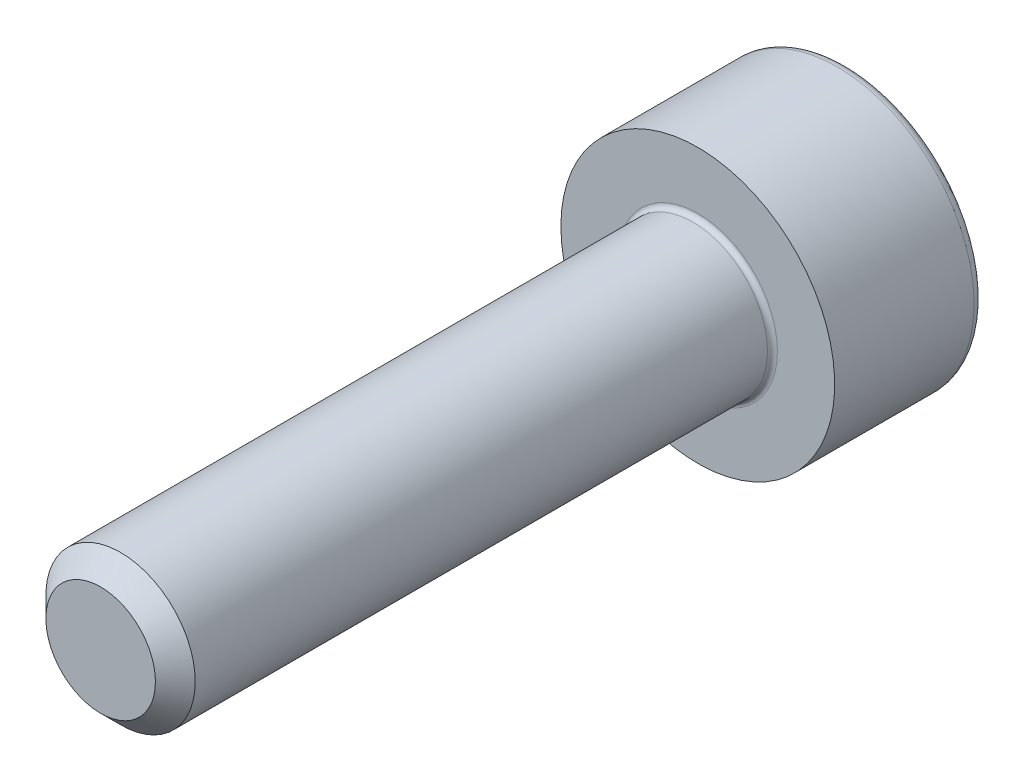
ISO-10303-21;
HEADER;
FILE_DESCRIPTION(('STEP AP214'),'2;1');
FILE_NAME('part.step','',(''),(''),'','','');
FILE_SCHEMA(('AUTOMOTIVE_DESIGN { 1 0 10303 214 1 1 1 1 }'));
ENDSEC;
DATA;
#1=APPLICATION_CONTEXT('core data for automotive mechanical design processes');
#2=APPLICATION_PROTOCOL_DEFINITION('international standard','automotive_design',2000,#1);
#3=PRODUCT_CONTEXT('',#1,'mechanical');
#4=PRODUCT('Part','Part','',(#3));
#5=PRODUCT_RELATED_PRODUCT_CATEGORY('part','',(#4));
#6=PRODUCT_DEFINITION_FORMATION('','',#4);
#7=PRODUCT_DEFINITION_CONTEXT('part definition',#1,'design');
#8=PRODUCT_DEFINITION('design','',#6,#7);
#9=PRODUCT_DEFINITION_SHAPE('','',#8);
#10=(LENGTH_UNIT() NAMED_UNIT(*) SI_UNIT(.MILLI.,.METRE.));
#11=(NAMED_UNIT(*) PLANE_ANGLE_UNIT() SI_UNIT($,.RADIAN.));
#12=(NAMED_UNIT(*) SI_UNIT($,.STERADIAN.) SOLID_ANGLE_UNIT());
#13=UNCERTAINTY_MEASURE_WITH_UNIT(LENGTH_MEASURE(1.E-05),#10,'distance_accuracy_value','');
#14=(GEOMETRIC_REPRESENTATION_CONTEXT(3) GLOBAL_UNCERTAINTY_ASSIGNED_CONTEXT((#13)) GLOBAL_UNIT_ASSIGNED_CONTEXT((#10,
#11,#12)) REPRESENTATION_CONTEXT('',''));
#15=CARTESIAN_POINT('',(0.,0.,0.));
#16=DIRECTION('',(0.,0.,1.));
#17=DIRECTION('',(1.,0.,0.));
#18=AXIS2_PLACEMENT_3D('',#15,#16,#17);
#19=CARTESIAN_POINT('',(14695.2255291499,-5639.90199648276,-590.000000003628));
#20=DIRECTION('',(0.,0.,-1.));
#21=DIRECTION('',(-1.,0.,0.));
#22=AXIS2_PLACEMENT_3D('',#19,#20,#21);
#23=CYLINDRICAL_SURFACE('',#22,2.7500000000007);
#24=CARTESIAN_POINT('',(14695.2255291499,-5639.90199648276,-592.800000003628));
#25=DIRECTION('',(0.,0.,-1.));
#26=DIRECTION('',(-1.,0.,0.));
#27=AXIS2_PLACEMENT_3D('',#24,#25,#26);
#28=CIRCLE('',#27,2.7500000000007);
#29=CARTESIAN_POINT('',(14692.4755291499,-5639.90199648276,-592.800000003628));
#30=VERTEX_POINT('',#29);
#31=EDGE_CURVE('E11',#30,#30,#28,.F.);
#32=ORIENTED_EDGE('',*,*,#31,.T.);
#33=EDGE_LOOP('',(#32));
#34=FACE_BOUND('',#33,.T.);
#35=CARTESIAN_POINT('',(14695.2255291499,-5639.90199648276,-590.000000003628));
#36=DIRECTION('',(0.,0.,-1.));
#37=DIRECTION('',(-1.,0.,0.));
#38=AXIS2_PLACEMENT_3D('',#35,#36,#37);
#39=CIRCLE('',#38,2.7500000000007);
#40=CARTESIAN_POINT('',(14692.4755291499,-5639.90199648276,-590.000000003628));
#41=VERTEX_POINT('',#40);
#42=EDGE_CURVE('E136',#41,#41,#39,.T.);
#43=ORIENTED_EDGE('',*,*,#42,.T.);
#44=EDGE_LOOP('',(#43));
#45=FACE_BOUND('',#44,.T.);
#46=ADVANCED_FACE('F34',(#34,#45),#23,.T.);
#47=CARTESIAN_POINT('',(14697.9755291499,-5639.90199648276,-590.000000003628));
#48=DIRECTION('',(0.,0.,1.));
#49=DIRECTION('',(1.,0.,0.));
#50=AXIS2_PLACEMENT_3D('',#47,#48,#49);
#51=PLANE('',#50);
#52=CARTESIAN_POINT('',(14695.2255291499,-5639.90199648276,-590.000000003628));
#53=DIRECTION('',(0.,0.,1.));
#54=DIRECTION('',(1.,0.,0.));
#55=AXIS2_PLACEMENT_3D('',#52,#53,#54);
#56=CIRCLE('',#55,1.60000000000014);
#57=CARTESIAN_POINT('',(14696.8255291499,-5639.90199648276,-590.000000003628));
#58=VERTEX_POINT('',#57);
#59=EDGE_CURVE('E153',#58,#58,#56,.F.);
#60=ORIENTED_EDGE('',*,*,#59,.T.);
#61=EDGE_LOOP('',(#60));
#62=FACE_BOUND('',#61,.T.);
#63=ORIENTED_EDGE('',*,*,#42,.F.);
#64=EDGE_LOOP('',(#63));
#65=FACE_BOUND('',#64,.T.);
#66=ADVANCED_FACE('F171',(#62,#65),#51,.T.);
#67=CARTESIAN_POINT('',(14695.2255291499,-5639.90199648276,-593.000000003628));
#68=DIRECTION('',(0.,0.,-1.));
#69=DIRECTION('',(-1.,0.,0.));
#70=AXIS2_PLACEMENT_3D('',#67,#68,#69);
#71=PLANE('',#70);
#72=CARTESIAN_POINT('',(14695.2255291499,-5639.90199648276,-593.000000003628));
#73=DIRECTION('',(0.,0.,-1.));
#74=DIRECTION('',(-1.,0.,0.));
#75=AXIS2_PLACEMENT_3D('',#72,#73,#74);
#76=CIRCLE('',#75,2.55000000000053);
#77=CARTESIAN_POINT('',(14692.6755291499,-5639.90199648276,-593.000000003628));
#78=VERTEX_POINT('',#77);
#79=EDGE_CURVE('E42',#78,#78,#76,.T.);
#80=ORIENTED_EDGE('',*,*,#79,.T.);
#81=EDGE_LOOP('',(#80));
#82=FACE_BOUND('',#81,.T.);
#83=DIRECTION('',(0.50000000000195,0.866025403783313,0.));
#84=VECTOR('',#83,1.);
#85=CARTESIAN_POINT('',(14693.7821534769,-5639.90199648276,-593.000000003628));
#86=LINE('',#85,#84);
#87=CARTESIAN_POINT('',(14693.7821534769,-5639.90199648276,-593.000000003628));
#88=VERTEX_POINT('',#87);
#89=CARTESIAN_POINT('',(14694.5038413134,-5638.65199648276,-593.000000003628));
#90=VERTEX_POINT('',#89);
#91=EDGE_CURVE('E49',#88,#90,#86,.T.);
#92=ORIENTED_EDGE('',*,*,#91,.F.);
#93=DIRECTION('',(-0.500000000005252,0.866025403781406,0.));
#94=VECTOR('',#93,1.);
#95=CARTESIAN_POINT('',(14694.5038413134,-5641.15199648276,-593.000000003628));
#96=LINE('',#95,#94);
#97=CARTESIAN_POINT('',(14694.5038413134,-5641.15199648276,-593.000000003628));
#98=VERTEX_POINT('',#97);
#99=EDGE_CURVE('E132',#98,#88,#96,.T.);
#100=ORIENTED_EDGE('',*,*,#99,.F.);
#101=DIRECTION('',(-1.,1.23069611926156E-12,0.));
#102=VECTOR('',#101,1.);
#103=CARTESIAN_POINT('',(14695.9472169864,-5641.15199648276,-593.000000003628));
#104=LINE('',#103,#102);
#105=CARTESIAN_POINT('',(14695.9472169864,-5641.15199648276,-593.000000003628));
#106=VERTEX_POINT('',#105);
#107=EDGE_CURVE('E130',#106,#98,#104,.T.);
#108=ORIENTED_EDGE('',*,*,#107,.F.);
#109=DIRECTION('',(-0.500000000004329,-0.866025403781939,0.));
#110=VECTOR('',#109,1.);
#111=CARTESIAN_POINT('',(14696.6689048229,-5639.90199648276,-593.000000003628));
#112=LINE('',#111,#110);
#113=CARTESIAN_POINT('',(14696.6689048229,-5639.90199648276,-593.000000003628));
#114=VERTEX_POINT('',#113);
#115=EDGE_CURVE('E97',#114,#106,#112,.T.);
#116=ORIENTED_EDGE('',*,*,#115,.F.);
#117=DIRECTION('',(0.500000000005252,-0.866025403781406,0.));
#118=VECTOR('',#117,1.);
#119=CARTESIAN_POINT('',(14695.9472169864,-5638.65199648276,-593.000000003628));
#120=LINE('',#119,#118);
#121=CARTESIAN_POINT('',(14695.9472169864,-5638.65199648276,-593.000000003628));
#122=VERTEX_POINT('',#121);
#123=EDGE_CURVE('E126',#122,#114,#120,.T.);
#124=ORIENTED_EDGE('',*,*,#123,.F.);
#125=DIRECTION('',(1.,-2.46139223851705E-12,0.));
#126=VECTOR('',#125,1.);
#127=CARTESIAN_POINT('',(14694.5038413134,-5638.65199648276,-593.000000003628));
#128=LINE('',#127,#126);
#129=EDGE_CURVE('E123',#90,#122,#128,.T.);
#130=ORIENTED_EDGE('',*,*,#129,.F.);
#131=EDGE_LOOP('',(#92,#100,#108,#116,#124,#130));
#132=FACE_BOUND('',#131,.T.);
#133=ADVANCED_FACE('F158',(#82,#132),#71,.T.);
#134=CARTESIAN_POINT('',(14695.2255291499,-5639.90199648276,-578.005000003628));
#135=DIRECTION('',(0.,0.,-1.));
#136=DIRECTION('',(-1.,0.,0.));
#137=AXIS2_PLACEMENT_3D('',#134,#135,#136);
#138=CYLINDRICAL_SURFACE('',#137,1.50000000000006);
#139=CARTESIAN_POINT('',(14695.2255291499,-5639.90199648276,-589.900000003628));
#140=DIRECTION('',(0.,0.,1.));
#141=DIRECTION('',(1.,0.,0.));
#142=AXIS2_PLACEMENT_3D('',#139,#140,#141);
#143=CIRCLE('',#142,1.50000000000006);
#144=CARTESIAN_POINT('',(14696.7255291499,-5639.90199648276,-589.900000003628));
#145=VERTEX_POINT('',#144);
#146=EDGE_CURVE('E150',#145,#145,#143,.T.);
#147=ORIENTED_EDGE('',*,*,#146,.T.);
#148=EDGE_LOOP('',(#147));
#149=FACE_BOUND('',#148,.T.);
#150=CARTESIAN_POINT('',(14695.2255291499,-5639.90199648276,-578.405000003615));
#151=DIRECTION('',(0.,0.,1.));
#152=DIRECTION('',(1.,0.,0.));
#153=AXIS2_PLACEMENT_3D('',#150,#151,#152);
#154=CIRCLE('',#153,1.50000000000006);
#155=CARTESIAN_POINT('',(14696.7255291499,-5639.90199648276,-578.405000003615));
#156=VERTEX_POINT('',#155);
#157=EDGE_CURVE('E147',#156,#156,#154,.F.);
#158=ORIENTED_EDGE('',*,*,#157,.T.);
#159=EDGE_LOOP('',(#158));
#160=FACE_BOUND('',#159,.T.);
#161=ADVANCED_FACE('F196',(#149,#160),#138,.T.);
#162=CARTESIAN_POINT('',(14695.2255291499,-5639.90199648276,-578.005000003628));
#163=DIRECTION('',(0.,0.,1.));
#164=DIRECTION('',(1.,0.,0.));
#165=AXIS2_PLACEMENT_3D('',#162,#163,#164);
#166=PLANE('',#165);
#167=CARTESIAN_POINT('',(14695.2255291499,-5639.90199648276,-578.005000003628));
#168=DIRECTION('',(0.,0.,1.));
#169=DIRECTION('',(1.,0.,0.));
#170=AXIS2_PLACEMENT_3D('',#167,#168,#169);
#171=CIRCLE('',#170,1.10000000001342);
#172=CARTESIAN_POINT('',(14696.3255291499,-5639.90199648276,-578.005000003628));
#173=VERTEX_POINT('',#172);
#174=EDGE_CURVE('E144',#173,#173,#171,.T.);
#175=ORIENTED_EDGE('',*,*,#174,.T.);
#176=EDGE_LOOP('',(#175));
#177=FACE_BOUND('',#176,.T.);
#178=ADVANCED_FACE('F193',(#177),#166,.T.);
#179=CARTESIAN_POINT('',(14693.7821534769,-5639.90199648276,-591.500000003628));
#180=DIRECTION('',(-0.866025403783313,0.50000000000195,0.));
#181=DIRECTION('',(-0.50000000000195,-0.866025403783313,0.));
#182=AXIS2_PLACEMENT_3D('',#179,#180,#181);
#183=PLANE('',#182);
#184=ORIENTED_EDGE('',*,*,#91,.T.);
#185=DIRECTION('',(0.,0.,-1.));
#186=VECTOR('',#185,1.);
#187=CARTESIAN_POINT('',(14694.5038413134,-5638.65199648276,-591.500000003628));
#188=LINE('',#187,#186);
#189=CARTESIAN_POINT('',(14694.5038413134,-5638.65199648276,-591.500000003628));
#190=VERTEX_POINT('',#189);
#191=EDGE_CURVE('E79',#190,#90,#188,.T.);
#192=ORIENTED_EDGE('',*,*,#191,.F.);
#193=DIRECTION('',(0.50000000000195,0.866025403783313,0.));
#194=VECTOR('',#193,1.);
#195=CARTESIAN_POINT('',(14693.7821534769,-5639.90199648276,-591.500000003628));
#196=LINE('',#195,#194);
#197=CARTESIAN_POINT('',(14693.7821534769,-5639.90199648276,-591.500000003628));
#198=VERTEX_POINT('',#197);
#199=EDGE_CURVE('E134',#198,#190,#196,.T.);
#200=ORIENTED_EDGE('',*,*,#199,.F.);
#201=DIRECTION('',(0.,0.,-1.));
#202=VECTOR('',#201,1.);
#203=CARTESIAN_POINT('',(14693.7821534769,-5639.90199648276,-591.500000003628));
#204=LINE('',#203,#202);
#205=EDGE_CURVE('E57',#198,#88,#204,.T.);
#206=ORIENTED_EDGE('',*,*,#205,.T.);
#207=EDGE_LOOP('',(#184,#192,#200,#206));
#208=FACE_BOUND('',#207,.T.);
#209=ADVANCED_FACE('F195',(#208),#183,.F.);
#210=CARTESIAN_POINT('',(14694.5038413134,-5641.15199648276,-591.500000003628));
#211=DIRECTION('',(-0.866025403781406,-0.500000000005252,0.));
#212=DIRECTION('',(0.500000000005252,-0.866025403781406,0.));
#213=AXIS2_PLACEMENT_3D('',#210,#211,#212);
#214=PLANE('',#213);
#215=ORIENTED_EDGE('',*,*,#99,.T.);
#216=ORIENTED_EDGE('',*,*,#205,.F.);
#217=DIRECTION('',(-0.500000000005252,0.866025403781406,0.));
#218=VECTOR('',#217,1.);
#219=CARTESIAN_POINT('',(14694.5038413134,-5641.15199648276,-591.500000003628));
#220=LINE('',#219,#218);
#221=CARTESIAN_POINT('',(14694.5038413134,-5641.15199648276,-591.500000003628));
#222=VERTEX_POINT('',#221);
#223=EDGE_CURVE('E109',#222,#198,#220,.T.);
#224=ORIENTED_EDGE('',*,*,#223,.F.);
#225=DIRECTION('',(0.,0.,-1.));
#226=VECTOR('',#225,1.);
#227=CARTESIAN_POINT('',(14694.5038413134,-5641.15199648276,-591.500000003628));
#228=LINE('',#227,#226);
#229=EDGE_CURVE('E101',#222,#98,#228,.T.);
#230=ORIENTED_EDGE('',*,*,#229,.T.);
#231=EDGE_LOOP('',(#215,#216,#224,#230));
#232=FACE_BOUND('',#231,.T.);
#233=ADVANCED_FACE('F202',(#232),#214,.F.);
#234=CARTESIAN_POINT('',(14695.9472169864,-5641.15199648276,-591.500000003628));
#235=DIRECTION('',(-1.23069611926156E-12,-1.,0.));
#236=DIRECTION('',(1.,-1.23069611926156E-12,0.));
#237=AXIS2_PLACEMENT_3D('',#234,#235,#236);
#238=PLANE('',#237);
#239=ORIENTED_EDGE('',*,*,#107,.T.);
#240=ORIENTED_EDGE('',*,*,#229,.F.);
#241=DIRECTION('',(-1.,1.23069611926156E-12,0.));
#242=VECTOR('',#241,1.);
#243=CARTESIAN_POINT('',(14695.9472169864,-5641.15199648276,-591.500000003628));
#244=LINE('',#243,#242);
#245=CARTESIAN_POINT('',(14695.9472169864,-5641.15199648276,-591.500000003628));
#246=VERTEX_POINT('',#245);
#247=EDGE_CURVE('E105',#246,#222,#244,.T.);
#248=ORIENTED_EDGE('',*,*,#247,.F.);
#249=DIRECTION('',(0.,0.,-1.));
#250=VECTOR('',#249,1.);
#251=CARTESIAN_POINT('',(14695.9472169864,-5641.15199648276,-591.500000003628));
#252=LINE('',#251,#250);
#253=EDGE_CURVE('E90',#246,#106,#252,.T.);
#254=ORIENTED_EDGE('',*,*,#253,.T.);
#255=EDGE_LOOP('',(#239,#240,#248,#254));
#256=FACE_BOUND('',#255,.T.);
#257=ADVANCED_FACE('F106',(#256),#238,.F.);
#258=CARTESIAN_POINT('',(14696.6689048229,-5639.90199648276,-591.500000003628));
#259=DIRECTION('',(0.866025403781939,-0.500000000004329,0.));
#260=DIRECTION('',(0.500000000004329,0.866025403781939,0.));
#261=AXIS2_PLACEMENT_3D('',#258,#259,#260);
#262=PLANE('',#261);
#263=ORIENTED_EDGE('',*,*,#115,.T.);
#264=ORIENTED_EDGE('',*,*,#253,.F.);
#265=DIRECTION('',(-0.500000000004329,-0.866025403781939,0.));
#266=VECTOR('',#265,1.);
#267=CARTESIAN_POINT('',(14696.6689048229,-5639.90199648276,-591.500000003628));
#268=LINE('',#267,#266);
#269=CARTESIAN_POINT('',(14696.6689048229,-5639.90199648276,-591.500000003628));
#270=VERTEX_POINT('',#269);
#271=EDGE_CURVE('E94',#270,#246,#268,.T.);
#272=ORIENTED_EDGE('',*,*,#271,.F.);
#273=DIRECTION('',(0.,0.,-1.));
#274=VECTOR('',#273,1.);
#275=CARTESIAN_POINT('',(14696.6689048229,-5639.90199648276,-591.500000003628));
#276=LINE('',#275,#274);
#277=EDGE_CURVE('E102',#270,#114,#276,.T.);
#278=ORIENTED_EDGE('',*,*,#277,.T.);
#279=EDGE_LOOP('',(#263,#264,#272,#278));
#280=FACE_BOUND('',#279,.T.);
#281=ADVANCED_FACE('F92',(#280),#262,.F.);
#282=CARTESIAN_POINT('',(14695.9472169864,-5638.65199648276,-591.500000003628));
#283=DIRECTION('',(0.866025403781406,0.500000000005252,0.));
#284=DIRECTION('',(-0.500000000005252,0.866025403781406,0.));
#285=AXIS2_PLACEMENT_3D('',#282,#283,#284);
#286=PLANE('',#285);
#287=ORIENTED_EDGE('',*,*,#123,.T.);
#288=ORIENTED_EDGE('',*,*,#277,.F.);
#289=DIRECTION('',(0.500000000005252,-0.866025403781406,0.));
#290=VECTOR('',#289,1.);
#291=CARTESIAN_POINT('',(14695.9472169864,-5638.65199648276,-591.500000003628));
#292=LINE('',#291,#290);
#293=CARTESIAN_POINT('',(14695.9472169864,-5638.65199648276,-591.500000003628));
#294=VERTEX_POINT('',#293);
#295=EDGE_CURVE('E115',#294,#270,#292,.T.);
#296=ORIENTED_EDGE('',*,*,#295,.F.);
#297=DIRECTION('',(0.,0.,-1.));
#298=VECTOR('',#297,1.);
#299=CARTESIAN_POINT('',(14695.9472169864,-5638.65199648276,-591.500000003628));
#300=LINE('',#299,#298);
#301=EDGE_CURVE('E139',#294,#122,#300,.T.);
#302=ORIENTED_EDGE('',*,*,#301,.T.);
#303=EDGE_LOOP('',(#287,#288,#296,#302));
#304=FACE_BOUND('',#303,.T.);
#305=ADVANCED_FACE('F256',(#304),#286,.F.);
#306=CARTESIAN_POINT('',(14694.5038413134,-5638.65199648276,-591.500000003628));
#307=DIRECTION('',(2.46139223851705E-12,1.,0.));
#308=DIRECTION('',(-1.,2.46139223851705E-12,0.));
#309=AXIS2_PLACEMENT_3D('',#306,#307,#308);
#310=PLANE('',#309);
#311=ORIENTED_EDGE('',*,*,#129,.T.);
#312=ORIENTED_EDGE('',*,*,#301,.F.);
#313=DIRECTION('',(1.,-2.46139223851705E-12,0.));
#314=VECTOR('',#313,1.);
#315=CARTESIAN_POINT('',(14694.5038413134,-5638.65199648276,-591.500000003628));
#316=LINE('',#315,#314);
#317=EDGE_CURVE('E117',#190,#294,#316,.T.);
#318=ORIENTED_EDGE('',*,*,#317,.F.);
#319=ORIENTED_EDGE('',*,*,#191,.T.);
#320=EDGE_LOOP('',(#311,#312,#318,#319));
#321=FACE_BOUND('',#320,.T.);
#322=ADVANCED_FACE('F187',(#321),#310,.F.);
#323=CARTESIAN_POINT('',(0.,0.,-591.500000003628));
#324=DIRECTION('',(0.,0.,-1.));
#325=DIRECTION('',(-1.,0.,0.));
#326=AXIS2_PLACEMENT_3D('',#323,#324,#325);
#327=PLANE('',#326);
#328=ORIENTED_EDGE('',*,*,#199,.T.);
#329=ORIENTED_EDGE('',*,*,#317,.T.);
#330=ORIENTED_EDGE('',*,*,#295,.T.);
#331=ORIENTED_EDGE('',*,*,#271,.T.);
#332=ORIENTED_EDGE('',*,*,#247,.T.);
#333=ORIENTED_EDGE('',*,*,#223,.T.);
#334=EDGE_LOOP('',(#328,#329,#330,#331,#332,#333));
#335=FACE_BOUND('',#334,.T.);
#336=ADVANCED_FACE('F112',(#335),#327,.T.);
#337=CARTESIAN_POINT('',(14695.2255291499,-5639.90199648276,-578.005000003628));
#338=DIRECTION('',(0.,0.,-1.));
#339=DIRECTION('',(-1.,0.,0.));
#340=AXIS2_PLACEMENT_3D('',#337,#338,#339);
#341=CONICAL_SURFACE('',#340,1.10000000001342,0.785398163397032);
#342=ORIENTED_EDGE('',*,*,#157,.F.);
#343=EDGE_LOOP('',(#342));
#344=FACE_BOUND('',#343,.T.);
#345=ORIENTED_EDGE('',*,*,#174,.F.);
#346=EDGE_LOOP('',(#345));
#347=FACE_BOUND('',#346,.T.);
#348=ADVANCED_FACE('F167',(#344,#347),#341,.T.);
#349=CARTESIAN_POINT('',(14695.2255291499,-5639.90199648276,-589.900000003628));
#350=DIRECTION('',(0.,0.,1.));
#351=DIRECTION('',(1.,0.,0.));
#352=AXIS2_PLACEMENT_3D('',#349,#350,#351);
#353=TOROIDAL_SURFACE('',#352,1.60000000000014,0.100000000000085);
#354=ORIENTED_EDGE('',*,*,#59,.F.);
#355=EDGE_LOOP('',(#354));
#356=FACE_BOUND('',#355,.T.);
#357=ORIENTED_EDGE('',*,*,#146,.F.);
#358=EDGE_LOOP('',(#357));
#359=FACE_BOUND('',#358,.T.);
#360=ADVANCED_FACE('F162',(#356,#359),#353,.F.);
#361=CARTESIAN_POINT('',(14695.2255291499,-5639.90199648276,-592.800000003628));
#362=DIRECTION('',(0.,0.,-1.));
#363=DIRECTION('',(-1.,0.,0.));
#364=AXIS2_PLACEMENT_3D('',#361,#362,#363);
#365=TOROIDAL_SURFACE('',#364,2.55000000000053,0.20000000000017);
#366=ORIENTED_EDGE('',*,*,#31,.F.);
#367=EDGE_LOOP('',(#366));
#368=FACE_BOUND('',#367,.T.);
#369=ORIENTED_EDGE('',*,*,#79,.F.);
#370=EDGE_LOOP('',(#369));
#371=FACE_BOUND('',#370,.T.);
#372=ADVANCED_FACE('F36',(#368,#371),#365,.T.);
#373=CLOSED_SHELL('',(#46,#66,#133,#161,#178,#209,#233,#257,#281,#305,#322,#336,#348,#360,#372));
#374=MANIFOLD_SOLID_BREP('B2',#373);
#375=ADVANCED_BREP_SHAPE_REPRESENTATION('',(#18,#374),#14);
#376=SHAPE_DEFINITION_REPRESENTATION(#9,#375);
ENDSEC;
END-ISO-10303-21;
